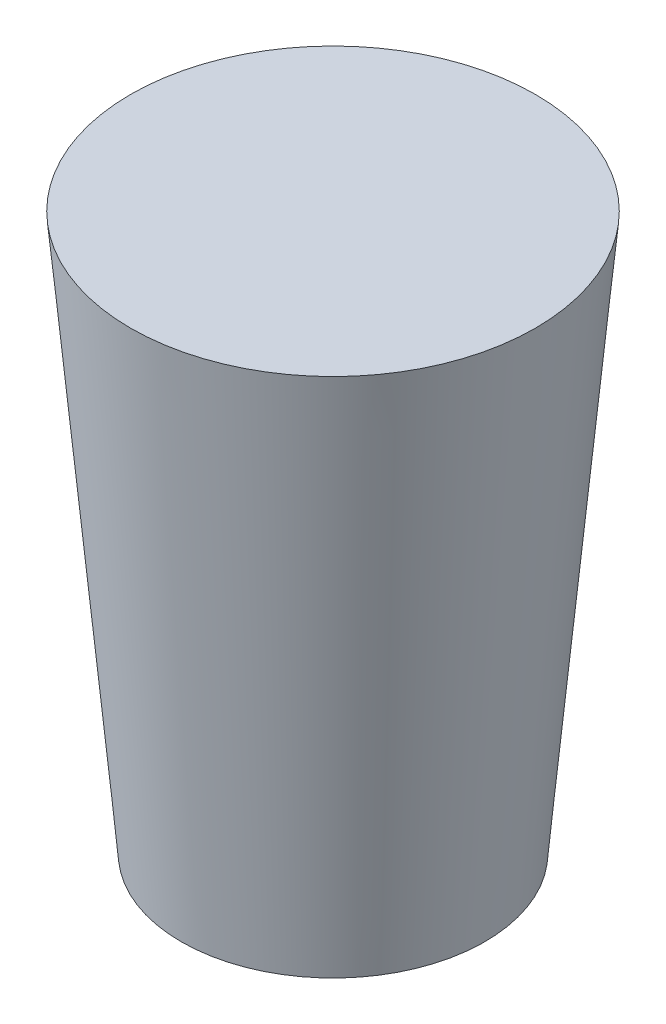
from build123d import *


with BuildPart() as part:
    # Esquisse1 → R_volution1 (revolve)
    with BuildSketch(Plane.XY, mode=Mode.PRIVATE) as r_volution1_sk:
        Polygon((-15.039626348, -25.384916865), (-24.039626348, -25.384916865), (-27.039626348, 7.615083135), (-15.039626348, 7.615083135), align=None)
    revolve(r_volution1_sk.sketch.rotate(Axis((-15.039626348, 7.615083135, 0), (0, -1, 0)), 270), axis=Axis((-15.039626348, 7.615083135, 0), (0, -1, 0)))


solid = part.part
